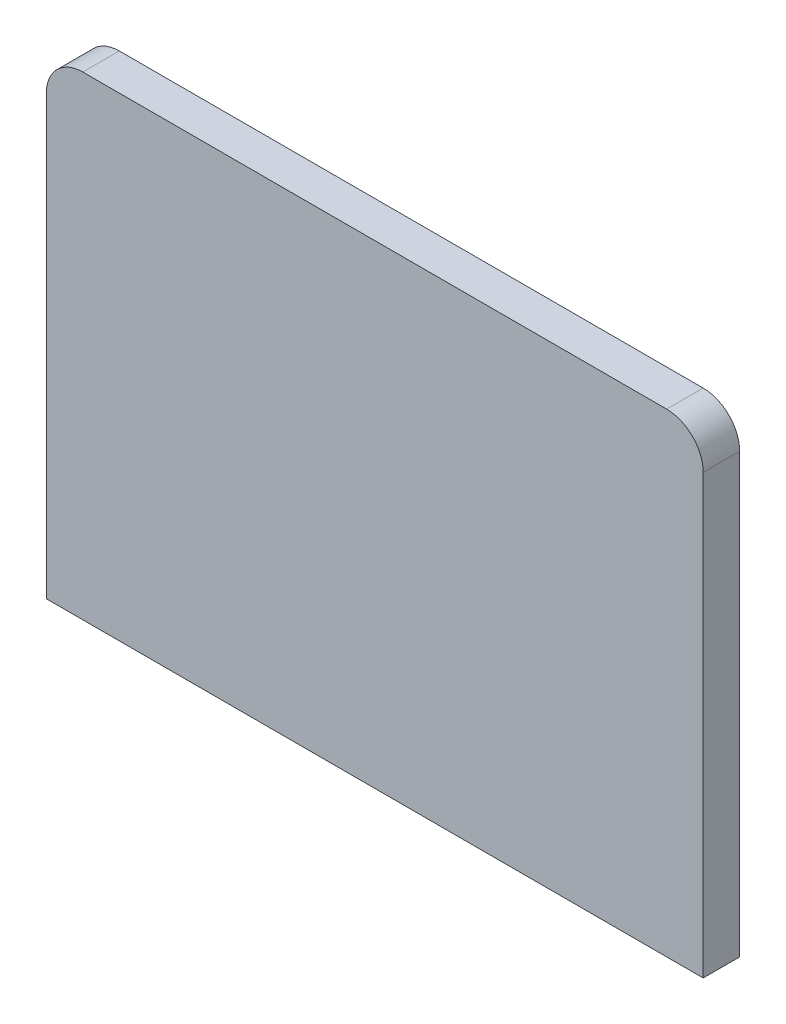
from build123d import *

# Parameters (mm, degrees)
BOSS_EXTRUDE1_DEPTH = 5


with BuildPart() as part:
    # Sketch2 → Boss-Extrude1 (new body)
    with BuildSketch(Plane.XY):
        with BuildLine():
            Line((45, 40), (45, 100))
            ThreePointArc((45, 100), (43.535533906, 103.535533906), (40, 105))
            Line((40, 105), (-40, 105))
            ThreePointArc((-40, 105), (-43.535533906, 103.535533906), (-45, 100))
            Line((-45, 100), (-45, 40))
            Line((-45, 40), (-12.5, 40))
            Line((-12.5, 40), (12.5, 40))
            Line((12.5, 40), (45, 40))
        make_face()
    extrude(amount=BOSS_EXTRUDE1_DEPTH)


solid = part.part
